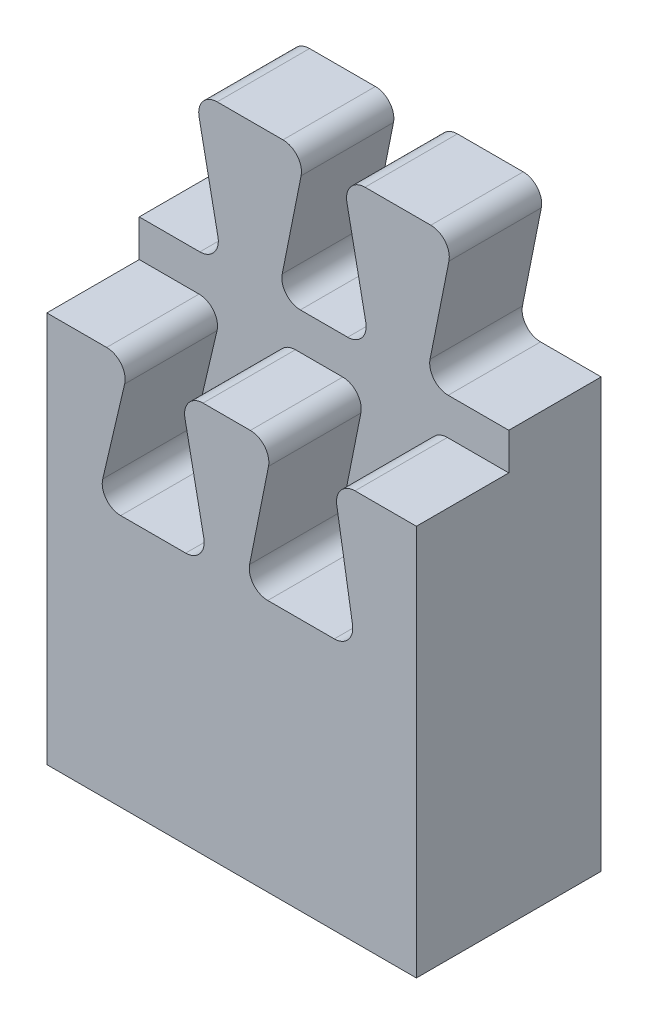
from build123d import *

# Parameters (mm, degrees)
AUFSATZ_LINEAR_AUSTRAGEN2_DEPTH = 5
AUFSATZ_LINEAR_AUSTRAGEN3_DEPTH = 5
VERRUNDUNG1_R                   = 1


with BuildPart() as part:
    # Skizze1 → Aufsatz-Linear austragen2 (new body)
    with BuildSketch(Plane.XY):
        Polygon((-1.733921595, 36.611215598), (2.766078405, 36.611215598), (1.266078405, 44.111215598), (7.266078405, 44.111215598), (5.766078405, 36.611215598), (10.766078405, 36.611215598), (9.266078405, 44.111215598), (15.266078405, 44.111215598), (13.766078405, 36.611215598), (18.266078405, 36.611215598), (18.266078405, 13.439459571), (-1.733921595, 13.439459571), align=None)
    extrude(amount=AUFSATZ_LINEAR_AUSTRAGEN2_DEPTH)

    # Skizze4 → Aufsatz-Linear austragen3 (add)
    with BuildSketch(Plane.XY.offset(5)):
        Polygon((-1.733921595, 34.611215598), (2.766078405, 34.611215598), (1.000919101, 27.111215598), (7.000919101, 27.111215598), (5.500919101, 34.611215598), (10.500919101, 34.611215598), (9.000919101, 27.111215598), (15.000919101, 27.111215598), (13.766078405, 34.611215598), (18.266078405, 34.611215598), (18.266078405, 13.439459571), (-1.733921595, 13.439459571), align=None)
    extrude(amount=AUFSATZ_LINEAR_AUSTRAGEN3_DEPTH)

    # Verrundung1
    verrundung1_edges = [part.edges().sort_by_distance(p)[0] for p in [
        (1.000919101, 27.111215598, 7.5),
        (5.500919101, 34.611215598, 7.5),
        (2.766078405, 34.611215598, 7.5),
        (2.766078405, 36.611215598, 2.5),
        (10.766078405, 36.611215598, 2.5),
        (15.000919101, 27.111215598, 7.5),
        (7.000919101, 27.111215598, 7.5),
        (9.000919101, 27.111215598, 7.5),
        (10.500919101, 34.611215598, 7.5),
        (13.766078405, 34.611215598, 7.5),
        (13.766078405, 36.611215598, 2.5),
        (15.266078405, 44.111215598, 2.5),
        (9.266078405, 44.111215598, 2.5),
        (1.266078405, 44.111215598, 2.5),
        (7.266078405, 44.111215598, 2.5),
        (5.766078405, 36.611215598, 2.5),
    ]]
    fillet(verrundung1_edges, radius=VERRUNDUNG1_R)


solid = part.part
